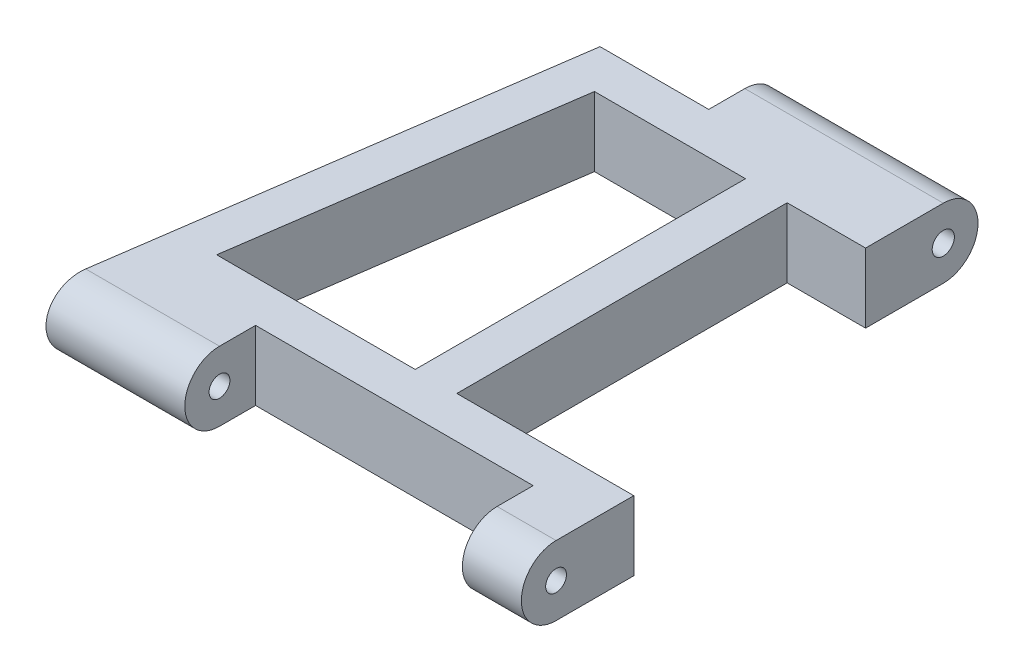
ISO-10303-21;
HEADER;
FILE_DESCRIPTION(('STEP AP214'),'2;1');
FILE_NAME('part.step','',(''),(''),'','','');
FILE_SCHEMA(('AUTOMOTIVE_DESIGN { 1 0 10303 214 1 1 1 1 }'));
ENDSEC;
DATA;
#1=APPLICATION_CONTEXT('core data for automotive mechanical design processes');
#2=APPLICATION_PROTOCOL_DEFINITION('international standard','automotive_design',2000,#1);
#3=PRODUCT_CONTEXT('',#1,'mechanical');
#4=PRODUCT('Part','Part','',(#3));
#5=PRODUCT_RELATED_PRODUCT_CATEGORY('part','',(#4));
#6=PRODUCT_DEFINITION_FORMATION('','',#4);
#7=PRODUCT_DEFINITION_CONTEXT('part definition',#1,'design');
#8=PRODUCT_DEFINITION('design','',#6,#7);
#9=PRODUCT_DEFINITION_SHAPE('','',#8);
#10=(LENGTH_UNIT() NAMED_UNIT(*) SI_UNIT(.MILLI.,.METRE.));
#11=(NAMED_UNIT(*) PLANE_ANGLE_UNIT() SI_UNIT($,.RADIAN.));
#12=(NAMED_UNIT(*) SI_UNIT($,.STERADIAN.) SOLID_ANGLE_UNIT());
#13=UNCERTAINTY_MEASURE_WITH_UNIT(LENGTH_MEASURE(1.E-05),#10,'distance_accuracy_value','');
#14=(GEOMETRIC_REPRESENTATION_CONTEXT(3) GLOBAL_UNCERTAINTY_ASSIGNED_CONTEXT((#13)) GLOBAL_UNIT_ASSIGNED_CONTEXT((#10,
#11,#12)) REPRESENTATION_CONTEXT('',''));
#15=CARTESIAN_POINT('',(0.,0.,0.));
#16=DIRECTION('',(0.,0.,1.));
#17=DIRECTION('',(1.,0.,0.));
#18=AXIS2_PLACEMENT_3D('',#15,#16,#17);
#19=CARTESIAN_POINT('',(-140.419266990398,10.,-20.1852696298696));
#20=DIRECTION('',(0.98982538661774,0.,0.1422873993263));
#21=DIRECTION('',(0.1422873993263,0.,-0.98982538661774));
#22=AXIS2_PLACEMENT_3D('',#19,#20,#21);
#23=PLANE('',#22);
#24=CARTESIAN_POINT('',(-138.818771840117,5.,-31.3191489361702));
#25=DIRECTION('',(0.98982538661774,0.,0.1422873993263));
#26=DIRECTION('',(-0.1422873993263,0.,0.98982538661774));
#27=AXIS2_PLACEMENT_3D('',#24,#25,#26);
#28=ELLIPSE('',#27,1.51541880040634,1.5);
#29=CARTESIAN_POINT('',(-139.034396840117,5.,-29.8191489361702));
#30=VERTEX_POINT('',#29);
#31=EDGE_CURVE('E403',#30,#30,#28,.T.);
#32=ORIENTED_EDGE('',*,*,#31,.T.);
#33=EDGE_LOOP('',(#32));
#34=FACE_BOUND('',#33,.T.);
#35=DIRECTION('',(-0.1422873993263,0.,0.98982538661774));
#36=VECTOR('',#35,1.);
#37=CARTESIAN_POINT('',(-140.419266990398,0.,-20.1852696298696));
#38=LINE('',#37,#36);
#39=CARTESIAN_POINT('',(-129.503771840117,0.,-96.1191489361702));
#40=VERTEX_POINT('',#39);
#41=CARTESIAN_POINT('',(-138.818771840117,0.,-31.3191489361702));
#42=VERTEX_POINT('',#41);
#43=EDGE_CURVE('E293',#40,#42,#38,.T.);
#44=ORIENTED_EDGE('',*,*,#43,.T.);
#45=CARTESIAN_POINT('',(-138.818771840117,5.,-31.3191489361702));
#46=DIRECTION('',(0.98982538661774,0.,0.1422873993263));
#47=DIRECTION('',(-0.1422873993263,0.,0.98982538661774));
#48=AXIS2_PLACEMENT_3D('',#45,#46,#47);
#49=ELLIPSE('',#48,5.05139600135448,5.);
#50=CARTESIAN_POINT('',(-138.818771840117,10.,-31.3191489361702));
#51=VERTEX_POINT('',#50);
#52=EDGE_CURVE('E376',#51,#42,#49,.T.);
#53=ORIENTED_EDGE('',*,*,#52,.F.);
#54=DIRECTION('',(-0.1422873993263,0.,0.98982538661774));
#55=VECTOR('',#54,1.);
#56=CARTESIAN_POINT('',(-140.419266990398,10.,-20.1852696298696));
#57=LINE('',#56,#55);
#58=CARTESIAN_POINT('',(-129.503771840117,10.,-96.1191489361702));
#59=VERTEX_POINT('',#58);
#60=EDGE_CURVE('E331',#59,#51,#57,.T.);
#61=ORIENTED_EDGE('',*,*,#60,.F.);
#62=DIRECTION('',(0.,-1.,0.));
#63=VECTOR('',#62,1.);
#64=CARTESIAN_POINT('',(-129.503771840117,10.,-96.1191489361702));
#65=LINE('',#64,#63);
#66=EDGE_CURVE('E292',#59,#40,#65,.T.);
#67=ORIENTED_EDGE('',*,*,#66,.T.);
#68=EDGE_LOOP('',(#44,#53,#61,#67));
#69=FACE_BOUND('',#68,.T.);
#70=ADVANCED_FACE('F162',(#34,#69),#23,.F.);
#71=CARTESIAN_POINT('',(-119.537521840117,10.,3.25277718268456E-13));
#72=DIRECTION('',(1.,0.,0.));
#73=DIRECTION('',(0.,0.,-1.));
#74=AXIS2_PLACEMENT_3D('',#71,#72,#73);
#75=PLANE('',#74);
#76=CARTESIAN_POINT('',(-119.537521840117,5.,-31.3191489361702));
#77=DIRECTION('',(1.,0.,0.));
#78=DIRECTION('',(0.,0.,-1.));
#79=AXIS2_PLACEMENT_3D('',#76,#77,#78);
#80=CIRCLE('',#79,1.5);
#81=CARTESIAN_POINT('',(-119.537521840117,5.,-32.8191489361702));
#82=VERTEX_POINT('',#81);
#83=EDGE_CURVE('E400',#82,#82,#80,.T.);
#84=ORIENTED_EDGE('',*,*,#83,.F.);
#85=EDGE_LOOP('',(#84));
#86=FACE_BOUND('',#85,.T.);
#87=CARTESIAN_POINT('',(-119.537521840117,5.,-31.3191489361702));
#88=DIRECTION('',(1.,0.,0.));
#89=DIRECTION('',(0.,0.,-1.));
#90=AXIS2_PLACEMENT_3D('',#87,#88,#89);
#91=CIRCLE('',#90,5.);
#92=CARTESIAN_POINT('',(-119.537521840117,10.,-31.3191489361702));
#93=VERTEX_POINT('',#92);
#94=CARTESIAN_POINT('',(-119.537521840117,0.,-31.3191489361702));
#95=VERTEX_POINT('',#94);
#96=EDGE_CURVE('E366',#93,#95,#91,.T.);
#97=ORIENTED_EDGE('',*,*,#96,.T.);
#98=DIRECTION('',(0.,0.,1.));
#99=VECTOR('',#98,1.);
#100=CARTESIAN_POINT('',(-119.537521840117,0.,3.25277718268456E-13));
#101=LINE('',#100,#99);
#102=CARTESIAN_POINT('',(-119.537521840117,0.,-36.5191489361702));
#103=VERTEX_POINT('',#102);
#104=EDGE_CURVE('E296',#103,#95,#101,.T.);
#105=ORIENTED_EDGE('',*,*,#104,.F.);
#106=DIRECTION('',(0.,-1.,0.));
#107=VECTOR('',#106,1.);
#108=CARTESIAN_POINT('',(-119.537521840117,10.,-36.5191489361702));
#109=LINE('',#108,#107);
#110=CARTESIAN_POINT('',(-119.537521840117,10.,-36.5191489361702));
#111=VERTEX_POINT('',#110);
#112=EDGE_CURVE('E165',#111,#103,#109,.T.);
#113=ORIENTED_EDGE('',*,*,#112,.F.);
#114=DIRECTION('',(0.,0.,1.));
#115=VECTOR('',#114,1.);
#116=CARTESIAN_POINT('',(-119.537521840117,10.,3.25277718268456E-13));
#117=LINE('',#116,#115);
#118=EDGE_CURVE('E369',#111,#93,#117,.T.);
#119=ORIENTED_EDGE('',*,*,#118,.T.);
#120=EDGE_LOOP('',(#97,#105,#113,#119));
#121=FACE_BOUND('',#120,.T.);
#122=ADVANCED_FACE('F364',(#86,#121),#75,.T.);
#123=CARTESIAN_POINT('',(-79.5375218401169,10.,0.));
#124=DIRECTION('',(1.,0.,0.));
#125=DIRECTION('',(0.,0.,-1.));
#126=AXIS2_PLACEMENT_3D('',#123,#124,#125);
#127=PLANE('',#126);
#128=CARTESIAN_POINT('',(-79.5375218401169,5.,-31.3191489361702));
#129=DIRECTION('',(1.,0.,0.));
#130=DIRECTION('',(0.,0.,-1.));
#131=AXIS2_PLACEMENT_3D('',#128,#129,#130);
#132=CIRCLE('',#131,1.5);
#133=CARTESIAN_POINT('',(-79.5375218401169,5.,-32.8191489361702));
#134=VERTEX_POINT('',#133);
#135=EDGE_CURVE('E397',#134,#134,#132,.T.);
#136=ORIENTED_EDGE('',*,*,#135,.T.);
#137=EDGE_LOOP('',(#136));
#138=FACE_BOUND('',#137,.T.);
#139=DIRECTION('',(0.,0.,1.));
#140=VECTOR('',#139,1.);
#141=CARTESIAN_POINT('',(-79.5375218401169,0.,0.));
#142=LINE('',#141,#140);
#143=CARTESIAN_POINT('',(-79.5375218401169,0.,-36.5191489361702));
#144=VERTEX_POINT('',#143);
#145=CARTESIAN_POINT('',(-79.5375218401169,0.,-31.3191489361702));
#146=VERTEX_POINT('',#145);
#147=EDGE_CURVE('E302',#144,#146,#142,.T.);
#148=ORIENTED_EDGE('',*,*,#147,.T.);
#149=CARTESIAN_POINT('',(-79.5375218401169,5.,-31.3191489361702));
#150=DIRECTION('',(1.,0.,0.));
#151=DIRECTION('',(0.,0.,-1.));
#152=AXIS2_PLACEMENT_3D('',#149,#150,#151);
#153=CIRCLE('',#152,5.);
#154=CARTESIAN_POINT('',(-79.5375218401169,10.,-31.3191489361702));
#155=VERTEX_POINT('',#154);
#156=EDGE_CURVE('E377',#155,#146,#153,.T.);
#157=ORIENTED_EDGE('',*,*,#156,.F.);
#158=DIRECTION('',(0.,0.,1.));
#159=VECTOR('',#158,1.);
#160=CARTESIAN_POINT('',(-79.5375218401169,10.,0.));
#161=LINE('',#160,#159);
#162=CARTESIAN_POINT('',(-79.5375218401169,10.,-36.5191489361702));
#163=VERTEX_POINT('',#162);
#164=EDGE_CURVE('E426',#163,#155,#161,.T.);
#165=ORIENTED_EDGE('',*,*,#164,.F.);
#166=DIRECTION('',(0.,-1.,0.));
#167=VECTOR('',#166,1.);
#168=CARTESIAN_POINT('',(-79.5375218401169,10.,-36.5191489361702));
#169=LINE('',#168,#167);
#170=EDGE_CURVE('E347',#163,#144,#169,.T.);
#171=ORIENTED_EDGE('',*,*,#170,.T.);
#172=EDGE_LOOP('',(#148,#157,#165,#171));
#173=FACE_BOUND('',#172,.T.);
#174=ADVANCED_FACE('F490',(#138,#173),#127,.F.);
#175=CARTESIAN_POINT('',(-71.0375218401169,10.,0.));
#176=DIRECTION('',(1.,0.,0.));
#177=DIRECTION('',(0.,0.,-1.));
#178=AXIS2_PLACEMENT_3D('',#175,#176,#177);
#179=PLANE('',#178);
#180=CARTESIAN_POINT('',(-71.0375218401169,5.,-31.3191489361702));
#181=DIRECTION('',(-1.,0.,0.));
#182=DIRECTION('',(0.,0.,1.));
#183=AXIS2_PLACEMENT_3D('',#180,#181,#182);
#184=CIRCLE('',#183,1.5);
#185=CARTESIAN_POINT('',(-71.0375218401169,5.,-29.8191489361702));
#186=VERTEX_POINT('',#185);
#187=EDGE_CURVE('E394',#186,#186,#184,.T.);
#188=ORIENTED_EDGE('',*,*,#187,.T.);
#189=EDGE_LOOP('',(#188));
#190=FACE_BOUND('',#189,.T.);
#191=CARTESIAN_POINT('',(-71.0375218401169,5.,-31.3191489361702));
#192=DIRECTION('',(-1.,0.,0.));
#193=DIRECTION('',(0.,0.,1.));
#194=AXIS2_PLACEMENT_3D('',#191,#192,#193);
#195=CIRCLE('',#194,5.);
#196=CARTESIAN_POINT('',(-71.0375218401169,0.,-31.3191489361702));
#197=VERTEX_POINT('',#196);
#198=CARTESIAN_POINT('',(-71.0375218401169,10.,-31.3191489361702));
#199=VERTEX_POINT('',#198);
#200=EDGE_CURVE('E386',#197,#199,#195,.T.);
#201=ORIENTED_EDGE('',*,*,#200,.F.);
#202=DIRECTION('',(0.,0.,1.));
#203=VECTOR('',#202,1.);
#204=CARTESIAN_POINT('',(-71.0375218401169,0.,0.));
#205=LINE('',#204,#203);
#206=CARTESIAN_POINT('',(-71.0375218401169,0.,-42.5191489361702));
#207=VERTEX_POINT('',#206);
#208=EDGE_CURVE('E305',#207,#197,#205,.T.);
#209=ORIENTED_EDGE('',*,*,#208,.F.);
#210=DIRECTION('',(0.,-1.,0.));
#211=VECTOR('',#210,1.);
#212=CARTESIAN_POINT('',(-71.0375218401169,10.,-42.5191489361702));
#213=LINE('',#212,#211);
#214=CARTESIAN_POINT('',(-71.0375218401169,10.,-42.5191489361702));
#215=VERTEX_POINT('',#214);
#216=EDGE_CURVE('E346',#215,#207,#213,.T.);
#217=ORIENTED_EDGE('',*,*,#216,.F.);
#218=DIRECTION('',(0.,0.,1.));
#219=VECTOR('',#218,1.);
#220=CARTESIAN_POINT('',(-71.0375218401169,10.,0.));
#221=LINE('',#220,#219);
#222=EDGE_CURVE('E429',#215,#199,#221,.T.);
#223=ORIENTED_EDGE('',*,*,#222,.T.);
#224=EDGE_LOOP('',(#201,#209,#217,#223));
#225=FACE_BOUND('',#224,.T.);
#226=ADVANCED_FACE('F477',(#190,#225),#179,.T.);
#227=CARTESIAN_POINT('',(-85.2375218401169,10.,0.));
#228=DIRECTION('',(1.,0.,0.));
#229=DIRECTION('',(0.,0.,-1.));
#230=AXIS2_PLACEMENT_3D('',#227,#228,#229);
#231=PLANE('',#230);
#232=CARTESIAN_POINT('',(-85.2375218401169,5.,-101.31914893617));
#233=DIRECTION('',(1.,0.,0.));
#234=DIRECTION('',(0.,0.,-1.));
#235=AXIS2_PLACEMENT_3D('',#232,#233,#234);
#236=CIRCLE('',#235,1.60000000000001);
#237=CARTESIAN_POINT('',(-85.2375218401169,5.,-102.91914893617));
#238=VERTEX_POINT('',#237);
#239=EDGE_CURVE('E297',#238,#238,#236,.F.);
#240=ORIENTED_EDGE('',*,*,#239,.T.);
#241=EDGE_LOOP('',(#240));
#242=FACE_BOUND('',#241,.T.);
#243=DIRECTION('',(0.,0.,1.));
#244=VECTOR('',#243,1.);
#245=CARTESIAN_POINT('',(-85.2375218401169,0.,0.));
#246=LINE('',#245,#244);
#247=CARTESIAN_POINT('',(-85.2375218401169,0.,-101.31914893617));
#248=VERTEX_POINT('',#247);
#249=CARTESIAN_POINT('',(-85.2375218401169,0.,-90.1191489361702));
#250=VERTEX_POINT('',#249);
#251=EDGE_CURVE('E317',#248,#250,#246,.T.);
#252=ORIENTED_EDGE('',*,*,#251,.F.);
#253=CARTESIAN_POINT('',(-85.2375218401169,5.,-101.31914893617));
#254=DIRECTION('',(1.,0.,0.));
#255=DIRECTION('',(0.,0.,-1.));
#256=AXIS2_PLACEMENT_3D('',#253,#254,#255);
#257=CIRCLE('',#256,5.);
#258=CARTESIAN_POINT('',(-85.2375218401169,10.,-101.31914893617));
#259=VERTEX_POINT('',#258);
#260=EDGE_CURVE('E411',#259,#248,#257,.F.);
#261=ORIENTED_EDGE('',*,*,#260,.F.);
#262=DIRECTION('',(0.,0.,1.));
#263=VECTOR('',#262,1.);
#264=CARTESIAN_POINT('',(-85.2375218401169,10.,0.));
#265=LINE('',#264,#263);
#266=CARTESIAN_POINT('',(-85.2375218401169,10.,-90.1191489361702));
#267=VERTEX_POINT('',#266);
#268=EDGE_CURVE('E440',#259,#267,#265,.T.);
#269=ORIENTED_EDGE('',*,*,#268,.T.);
#270=DIRECTION('',(0.,-1.,0.));
#271=VECTOR('',#270,1.);
#272=CARTESIAN_POINT('',(-85.2375218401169,10.,-90.1191489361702));
#273=LINE('',#272,#271);
#274=EDGE_CURVE('E339',#267,#250,#273,.T.);
#275=ORIENTED_EDGE('',*,*,#274,.T.);
#276=EDGE_LOOP('',(#252,#261,#269,#275));
#277=FACE_BOUND('',#276,.T.);
#278=ADVANCED_FACE('F498',(#242,#277),#231,.T.);
#279=CARTESIAN_POINT('',(-113.837521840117,10.,0.));
#280=DIRECTION('',(1.,0.,0.));
#281=DIRECTION('',(0.,0.,-1.));
#282=AXIS2_PLACEMENT_3D('',#279,#280,#281);
#283=PLANE('',#282);
#284=CARTESIAN_POINT('',(-113.837521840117,5.,-101.31914893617));
#285=DIRECTION('',(-1.,0.,0.));
#286=DIRECTION('',(0.,0.,1.));
#287=AXIS2_PLACEMENT_3D('',#284,#285,#286);
#288=CIRCLE('',#287,1.60000000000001);
#289=CARTESIAN_POINT('',(-113.837521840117,5.,-99.7191489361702));
#290=VERTEX_POINT('',#289);
#291=EDGE_CURVE('E413',#290,#290,#288,.T.);
#292=ORIENTED_EDGE('',*,*,#291,.F.);
#293=EDGE_LOOP('',(#292));
#294=FACE_BOUND('',#293,.T.);
#295=CARTESIAN_POINT('',(-113.837521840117,5.,-101.31914893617));
#296=DIRECTION('',(-1.,0.,0.));
#297=DIRECTION('',(0.,0.,1.));
#298=AXIS2_PLACEMENT_3D('',#295,#296,#297);
#299=CIRCLE('',#298,5.);
#300=CARTESIAN_POINT('',(-113.837521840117,10.,-101.31914893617));
#301=VERTEX_POINT('',#300);
#302=CARTESIAN_POINT('',(-113.837521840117,0.,-101.31914893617));
#303=VERTEX_POINT('',#302);
#304=EDGE_CURVE('E178',#301,#303,#299,.T.);
#305=ORIENTED_EDGE('',*,*,#304,.T.);
#306=DIRECTION('',(0.,0.,1.));
#307=VECTOR('',#306,1.);
#308=CARTESIAN_POINT('',(-113.837521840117,0.,0.));
#309=LINE('',#308,#307);
#310=CARTESIAN_POINT('',(-113.837521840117,0.,-96.1191489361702));
#311=VERTEX_POINT('',#310);
#312=EDGE_CURVE('E319',#303,#311,#309,.T.);
#313=ORIENTED_EDGE('',*,*,#312,.T.);
#314=DIRECTION('',(0.,-1.,0.));
#315=VECTOR('',#314,1.);
#316=CARTESIAN_POINT('',(-113.837521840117,10.,-96.1191489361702));
#317=LINE('',#316,#315);
#318=CARTESIAN_POINT('',(-113.837521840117,10.,-96.1191489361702));
#319=VERTEX_POINT('',#318);
#320=EDGE_CURVE('E336',#319,#311,#317,.T.);
#321=ORIENTED_EDGE('',*,*,#320,.F.);
#322=DIRECTION('',(0.,0.,1.));
#323=VECTOR('',#322,1.);
#324=CARTESIAN_POINT('',(-113.837521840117,10.,0.));
#325=LINE('',#324,#323);
#326=EDGE_CURVE('E442',#301,#319,#325,.T.);
#327=ORIENTED_EDGE('',*,*,#326,.F.);
#328=EDGE_LOOP('',(#305,#313,#321,#327));
#329=FACE_BOUND('',#328,.T.);
#330=ADVANCED_FACE('F456',(#294,#329),#283,.F.);
#331=CARTESIAN_POINT('',(0.,0.,0.));
#332=DIRECTION('',(0.,1.,0.));
#333=DIRECTION('',(0.,0.,1.));
#334=AXIS2_PLACEMENT_3D('',#331,#332,#333);
#335=PLANE('',#334);
#336=DIRECTION('',(-1.,0.,0.));
#337=VECTOR('',#336,1.);
#338=CARTESIAN_POINT('',(0.,0.,-42.5191489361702));
#339=LINE('',#338,#337);
#340=CARTESIAN_POINT('',(-102.537521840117,0.,-42.5191489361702));
#341=VERTEX_POINT('',#340);
#342=CARTESIAN_POINT('',(-131.147096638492,0.,-42.5191489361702));
#343=VERTEX_POINT('',#342);
#344=EDGE_CURVE('E324',#341,#343,#339,.T.);
#345=ORIENTED_EDGE('',*,*,#344,.F.);
#346=DIRECTION('',(0.,0.,1.));
#347=VECTOR('',#346,1.);
#348=CARTESIAN_POINT('',(-102.537521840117,0.,0.));
#349=LINE('',#348,#347);
#350=CARTESIAN_POINT('',(-102.537521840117,0.,-90.1191489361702));
#351=VERTEX_POINT('',#350);
#352=EDGE_CURVE('E231',#351,#341,#349,.T.);
#353=ORIENTED_EDGE('',*,*,#352,.F.);
#354=DIRECTION('',(1.,0.,0.));
#355=VECTOR('',#354,1.);
#356=CARTESIAN_POINT('',(0.,0.,-90.1191489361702));
#357=LINE('',#356,#355);
#358=CARTESIAN_POINT('',(-124.304596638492,0.,-90.1191489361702));
#359=VERTEX_POINT('',#358);
#360=EDGE_CURVE('E328',#359,#351,#357,.T.);
#361=ORIENTED_EDGE('',*,*,#360,.F.);
#362=DIRECTION('',(-0.1422873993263,0.,0.98982538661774));
#363=VECTOR('',#362,1.);
#364=CARTESIAN_POINT('',(-134.480314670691,0.,-19.3315452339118));
#365=LINE('',#364,#363);
#366=EDGE_CURVE('E273',#359,#343,#365,.T.);
#367=ORIENTED_EDGE('',*,*,#366,.T.);
#368=EDGE_LOOP('',(#345,#353,#361,#367));
#369=FACE_BOUND('',#368,.T.);
#370=ORIENTED_EDGE('',*,*,#208,.T.);
#371=DIRECTION('',(-1.,0.,0.));
#372=VECTOR('',#371,1.);
#373=CARTESIAN_POINT('',(-71.0375218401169,0.,-31.3191489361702));
#374=LINE('',#373,#372);
#375=EDGE_CURVE('E384',#197,#146,#374,.T.);
#376=ORIENTED_EDGE('',*,*,#375,.T.);
#377=ORIENTED_EDGE('',*,*,#147,.F.);
#378=DIRECTION('',(1.,0.,0.));
#379=VECTOR('',#378,1.);
#380=CARTESIAN_POINT('',(0.,0.,-36.5191489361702));
#381=LINE('',#380,#379);
#382=EDGE_CURVE('E300',#103,#144,#381,.T.);
#383=ORIENTED_EDGE('',*,*,#382,.F.);
#384=ORIENTED_EDGE('',*,*,#104,.T.);
#385=EDGE_CURVE('E380',#95,#42,#374,.T.);
#386=ORIENTED_EDGE('',*,*,#385,.T.);
#387=ORIENTED_EDGE('',*,*,#43,.F.);
#388=DIRECTION('',(1.,0.,0.));
#389=VECTOR('',#388,1.);
#390=CARTESIAN_POINT('',(0.,0.,-96.1191489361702));
#391=LINE('',#390,#389);
#392=EDGE_CURVE('E321',#40,#311,#391,.T.);
#393=ORIENTED_EDGE('',*,*,#392,.T.);
#394=ORIENTED_EDGE('',*,*,#312,.F.);
#395=DIRECTION('',(-1.,0.,0.));
#396=VECTOR('',#395,1.);
#397=CARTESIAN_POINT('',(-78.1664540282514,0.,-101.31914893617));
#398=LINE('',#397,#396);
#399=EDGE_CURVE('E409',#248,#303,#398,.T.);
#400=ORIENTED_EDGE('',*,*,#399,.F.);
#401=ORIENTED_EDGE('',*,*,#251,.T.);
#402=DIRECTION('',(1.,0.,0.));
#403=VECTOR('',#402,1.);
#404=CARTESIAN_POINT('',(0.,0.,-90.1191489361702));
#405=LINE('',#404,#403);
#406=CARTESIAN_POINT('',(-96.5375218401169,0.,-90.1191489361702));
#407=VERTEX_POINT('',#406);
#408=EDGE_CURVE('E314',#407,#250,#405,.T.);
#409=ORIENTED_EDGE('',*,*,#408,.F.);
#410=DIRECTION('',(0.,0.,1.));
#411=VECTOR('',#410,1.);
#412=CARTESIAN_POINT('',(-96.5375218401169,0.,0.));
#413=LINE('',#412,#411);
#414=CARTESIAN_POINT('',(-96.5375218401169,0.,-42.5191489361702));
#415=VERTEX_POINT('',#414);
#416=EDGE_CURVE('E311',#407,#415,#413,.T.);
#417=ORIENTED_EDGE('',*,*,#416,.T.);
#418=DIRECTION('',(-1.,0.,0.));
#419=VECTOR('',#418,1.);
#420=CARTESIAN_POINT('',(0.,0.,-42.5191489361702));
#421=LINE('',#420,#419);
#422=EDGE_CURVE('E308',#207,#415,#421,.T.);
#423=ORIENTED_EDGE('',*,*,#422,.F.);
#424=EDGE_LOOP('',(#370,#376,#377,#383,#384,#386,#387,#393,#394,#400,#401,#409,#417,#423));
#425=FACE_BOUND('',#424,.T.);
#426=ADVANCED_FACE('F359',(#369,#425),#335,.F.);
#427=CARTESIAN_POINT('',(0.,10.,0.));
#428=DIRECTION('',(0.,1.,0.));
#429=DIRECTION('',(0.,0.,1.));
#430=AXIS2_PLACEMENT_3D('',#427,#428,#429);
#431=PLANE('',#430);
#432=DIRECTION('',(-1.,0.,0.));
#433=VECTOR('',#432,1.);
#434=CARTESIAN_POINT('',(-71.0375218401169,10.,-31.3191489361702));
#435=LINE('',#434,#433);
#436=EDGE_CURVE('E391',#199,#155,#435,.T.);
#437=ORIENTED_EDGE('',*,*,#436,.F.);
#438=ORIENTED_EDGE('',*,*,#222,.F.);
#439=DIRECTION('',(-1.,0.,0.));
#440=VECTOR('',#439,1.);
#441=CARTESIAN_POINT('',(0.,10.,-42.5191489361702));
#442=LINE('',#441,#440);
#443=CARTESIAN_POINT('',(-96.5375218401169,10.,-42.5191489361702));
#444=VERTEX_POINT('',#443);
#445=EDGE_CURVE('E432',#215,#444,#442,.T.);
#446=ORIENTED_EDGE('',*,*,#445,.T.);
#447=DIRECTION('',(0.,0.,1.));
#448=VECTOR('',#447,1.);
#449=CARTESIAN_POINT('',(-96.5375218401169,10.,0.));
#450=LINE('',#449,#448);
#451=CARTESIAN_POINT('',(-96.5375218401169,10.,-90.1191489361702));
#452=VERTEX_POINT('',#451);
#453=EDGE_CURVE('E434',#452,#444,#450,.T.);
#454=ORIENTED_EDGE('',*,*,#453,.F.);
#455=DIRECTION('',(1.,0.,0.));
#456=VECTOR('',#455,1.);
#457=CARTESIAN_POINT('',(0.,10.,-90.1191489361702));
#458=LINE('',#457,#456);
#459=EDGE_CURVE('E437',#452,#267,#458,.T.);
#460=ORIENTED_EDGE('',*,*,#459,.T.);
#461=ORIENTED_EDGE('',*,*,#268,.F.);
#462=DIRECTION('',(-1.,0.,0.));
#463=VECTOR('',#462,1.);
#464=CARTESIAN_POINT('',(-78.1664540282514,10.,-101.31914893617));
#465=LINE('',#464,#463);
#466=EDGE_CURVE('E414',#259,#301,#465,.T.);
#467=ORIENTED_EDGE('',*,*,#466,.T.);
#468=ORIENTED_EDGE('',*,*,#326,.T.);
#469=DIRECTION('',(1.,0.,0.));
#470=VECTOR('',#469,1.);
#471=CARTESIAN_POINT('',(0.,10.,-96.1191489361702));
#472=LINE('',#471,#470);
#473=EDGE_CURVE('E287',#59,#319,#472,.T.);
#474=ORIENTED_EDGE('',*,*,#473,.F.);
#475=ORIENTED_EDGE('',*,*,#60,.T.);
#476=EDGE_CURVE('E390',#93,#51,#435,.T.);
#477=ORIENTED_EDGE('',*,*,#476,.F.);
#478=ORIENTED_EDGE('',*,*,#118,.F.);
#479=DIRECTION('',(1.,0.,0.));
#480=VECTOR('',#479,1.);
#481=CARTESIAN_POINT('',(0.,10.,-36.5191489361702));
#482=LINE('',#481,#480);
#483=EDGE_CURVE('E356',#111,#163,#482,.T.);
#484=ORIENTED_EDGE('',*,*,#483,.T.);
#485=ORIENTED_EDGE('',*,*,#164,.T.);
#486=EDGE_LOOP('',(#437,#438,#446,#454,#460,#461,#467,#468,#474,#475,#477,#478,#484,#485));
#487=FACE_BOUND('',#486,.T.);
#488=DIRECTION('',(-1.,0.,0.));
#489=VECTOR('',#488,1.);
#490=CARTESIAN_POINT('',(0.,10.,-42.5191489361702));
#491=LINE('',#490,#489);
#492=CARTESIAN_POINT('',(-102.537521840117,10.,-42.5191489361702));
#493=VERTEX_POINT('',#492);
#494=CARTESIAN_POINT('',(-131.147096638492,10.,-42.5191489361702));
#495=VERTEX_POINT('',#494);
#496=EDGE_CURVE('E284',#493,#495,#491,.T.);
#497=ORIENTED_EDGE('',*,*,#496,.T.);
#498=DIRECTION('',(-0.1422873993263,0.,0.98982538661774));
#499=VECTOR('',#498,1.);
#500=CARTESIAN_POINT('',(-134.480314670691,10.,-19.3315452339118));
#501=LINE('',#500,#499);
#502=CARTESIAN_POINT('',(-124.304596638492,10.,-90.1191489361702));
#503=VERTEX_POINT('',#502);
#504=EDGE_CURVE('E271',#503,#495,#501,.T.);
#505=ORIENTED_EDGE('',*,*,#504,.F.);
#506=DIRECTION('',(1.,0.,0.));
#507=VECTOR('',#506,1.);
#508=CARTESIAN_POINT('',(0.,10.,-90.1191489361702));
#509=LINE('',#508,#507);
#510=CARTESIAN_POINT('',(-102.537521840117,10.,-90.1191489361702));
#511=VERTEX_POINT('',#510);
#512=EDGE_CURVE('E279',#503,#511,#509,.T.);
#513=ORIENTED_EDGE('',*,*,#512,.T.);
#514=DIRECTION('',(0.,0.,1.));
#515=VECTOR('',#514,1.);
#516=CARTESIAN_POINT('',(-102.537521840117,10.,0.));
#517=LINE('',#516,#515);
#518=EDGE_CURVE('E187',#511,#493,#517,.T.);
#519=ORIENTED_EDGE('',*,*,#518,.T.);
#520=EDGE_LOOP('',(#497,#505,#513,#519));
#521=FACE_BOUND('',#520,.T.);
#522=ADVANCED_FACE('F282',(#487,#521),#431,.T.);
#523=CARTESIAN_POINT('',(0.,10.,-42.5191489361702));
#524=DIRECTION('',(0.,0.,1.));
#525=DIRECTION('',(1.,0.,0.));
#526=AXIS2_PLACEMENT_3D('',#523,#524,#525);
#527=PLANE('',#526);
#528=ORIENTED_EDGE('',*,*,#344,.T.);
#529=DIRECTION('',(0.,-1.,0.));
#530=VECTOR('',#529,1.);
#531=CARTESIAN_POINT('',(-131.147096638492,10.,-42.5191489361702));
#532=LINE('',#531,#530);
#533=EDGE_CURVE('E12',#495,#343,#532,.T.);
#534=ORIENTED_EDGE('',*,*,#533,.F.);
#535=ORIENTED_EDGE('',*,*,#496,.F.);
#536=DIRECTION('',(0.,-1.,0.));
#537=VECTOR('',#536,1.);
#538=CARTESIAN_POINT('',(-102.537521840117,10.,-42.5191489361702));
#539=LINE('',#538,#537);
#540=EDGE_CURVE('E332',#493,#341,#539,.T.);
#541=ORIENTED_EDGE('',*,*,#540,.T.);
#542=EDGE_LOOP('',(#528,#534,#535,#541));
#543=FACE_BOUND('',#542,.T.);
#544=ADVANCED_FACE('F541',(#543),#527,.F.);
#545=CARTESIAN_POINT('',(-134.480314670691,10.,-19.3315452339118));
#546=DIRECTION('',(0.98982538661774,0.,0.1422873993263));
#547=DIRECTION('',(0.1422873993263,0.,-0.98982538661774));
#548=AXIS2_PLACEMENT_3D('',#545,#546,#547);
#549=PLANE('',#548);
#550=ORIENTED_EDGE('',*,*,#366,.F.);
#551=DIRECTION('',(0.,-1.,0.));
#552=VECTOR('',#551,1.);
#553=CARTESIAN_POINT('',(-124.304596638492,10.,-90.1191489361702));
#554=LINE('',#553,#552);
#555=EDGE_CURVE('E170',#503,#359,#554,.T.);
#556=ORIENTED_EDGE('',*,*,#555,.F.);
#557=ORIENTED_EDGE('',*,*,#504,.T.);
#558=ORIENTED_EDGE('',*,*,#533,.T.);
#559=EDGE_LOOP('',(#550,#556,#557,#558));
#560=FACE_BOUND('',#559,.T.);
#561=ADVANCED_FACE('F269',(#560),#549,.T.);
#562=CARTESIAN_POINT('',(0.,10.,-90.1191489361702));
#563=DIRECTION('',(0.,0.,-1.));
#564=DIRECTION('',(-1.,0.,0.));
#565=AXIS2_PLACEMENT_3D('',#562,#563,#564);
#566=PLANE('',#565);
#567=ORIENTED_EDGE('',*,*,#360,.T.);
#568=DIRECTION('',(0.,-1.,0.));
#569=VECTOR('',#568,1.);
#570=CARTESIAN_POINT('',(-102.537521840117,10.,-90.1191489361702));
#571=LINE('',#570,#569);
#572=EDGE_CURVE('E276',#511,#351,#571,.T.);
#573=ORIENTED_EDGE('',*,*,#572,.F.);
#574=ORIENTED_EDGE('',*,*,#512,.F.);
#575=ORIENTED_EDGE('',*,*,#555,.T.);
#576=EDGE_LOOP('',(#567,#573,#574,#575));
#577=FACE_BOUND('',#576,.T.);
#578=ADVANCED_FACE('F280',(#577),#566,.F.);
#579=CARTESIAN_POINT('',(0.,10.,-36.5191489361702));
#580=DIRECTION('',(0.,0.,-1.));
#581=DIRECTION('',(-1.,0.,0.));
#582=AXIS2_PLACEMENT_3D('',#579,#580,#581);
#583=PLANE('',#582);
#584=ORIENTED_EDGE('',*,*,#382,.T.);
#585=ORIENTED_EDGE('',*,*,#170,.F.);
#586=ORIENTED_EDGE('',*,*,#483,.F.);
#587=ORIENTED_EDGE('',*,*,#112,.T.);
#588=EDGE_LOOP('',(#584,#585,#586,#587));
#589=FACE_BOUND('',#588,.T.);
#590=ADVANCED_FACE('F355',(#589),#583,.F.);
#591=CARTESIAN_POINT('',(0.,10.,-42.5191489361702));
#592=DIRECTION('',(0.,0.,1.));
#593=DIRECTION('',(1.,0.,0.));
#594=AXIS2_PLACEMENT_3D('',#591,#592,#593);
#595=PLANE('',#594);
#596=ORIENTED_EDGE('',*,*,#422,.T.);
#597=DIRECTION('',(0.,-1.,0.));
#598=VECTOR('',#597,1.);
#599=CARTESIAN_POINT('',(-96.5375218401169,10.,-42.5191489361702));
#600=LINE('',#599,#598);
#601=EDGE_CURVE('E344',#444,#415,#600,.T.);
#602=ORIENTED_EDGE('',*,*,#601,.F.);
#603=ORIENTED_EDGE('',*,*,#445,.F.);
#604=ORIENTED_EDGE('',*,*,#216,.T.);
#605=EDGE_LOOP('',(#596,#602,#603,#604));
#606=FACE_BOUND('',#605,.T.);
#607=ADVANCED_FACE('F487',(#606),#595,.F.);
#608=CARTESIAN_POINT('',(-96.5375218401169,10.,0.));
#609=DIRECTION('',(1.,0.,0.));
#610=DIRECTION('',(0.,0.,-1.));
#611=AXIS2_PLACEMENT_3D('',#608,#609,#610);
#612=PLANE('',#611);
#613=ORIENTED_EDGE('',*,*,#416,.F.);
#614=DIRECTION('',(0.,-1.,0.));
#615=VECTOR('',#614,1.);
#616=CARTESIAN_POINT('',(-96.5375218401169,10.,-90.1191489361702));
#617=LINE('',#616,#615);
#618=EDGE_CURVE('E342',#452,#407,#617,.T.);
#619=ORIENTED_EDGE('',*,*,#618,.F.);
#620=ORIENTED_EDGE('',*,*,#453,.T.);
#621=ORIENTED_EDGE('',*,*,#601,.T.);
#622=EDGE_LOOP('',(#613,#619,#620,#621));
#623=FACE_BOUND('',#622,.T.);
#624=ADVANCED_FACE('F565',(#623),#612,.T.);
#625=CARTESIAN_POINT('',(0.,10.,-90.1191489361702));
#626=DIRECTION('',(0.,0.,-1.));
#627=DIRECTION('',(-1.,0.,0.));
#628=AXIS2_PLACEMENT_3D('',#625,#626,#627);
#629=PLANE('',#628);
#630=ORIENTED_EDGE('',*,*,#408,.T.);
#631=ORIENTED_EDGE('',*,*,#274,.F.);
#632=ORIENTED_EDGE('',*,*,#459,.F.);
#633=ORIENTED_EDGE('',*,*,#618,.T.);
#634=EDGE_LOOP('',(#630,#631,#632,#633));
#635=FACE_BOUND('',#634,.T.);
#636=ADVANCED_FACE('F556',(#635),#629,.F.);
#637=CARTESIAN_POINT('',(0.,10.,-96.1191489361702));
#638=DIRECTION('',(0.,0.,-1.));
#639=DIRECTION('',(-1.,0.,0.));
#640=AXIS2_PLACEMENT_3D('',#637,#638,#639);
#641=PLANE('',#640);
#642=ORIENTED_EDGE('',*,*,#392,.F.);
#643=ORIENTED_EDGE('',*,*,#66,.F.);
#644=ORIENTED_EDGE('',*,*,#473,.T.);
#645=ORIENTED_EDGE('',*,*,#320,.T.);
#646=EDGE_LOOP('',(#642,#643,#644,#645));
#647=FACE_BOUND('',#646,.T.);
#648=ADVANCED_FACE('F447',(#647),#641,.T.);
#649=CARTESIAN_POINT('',(-102.537521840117,10.,0.));
#650=DIRECTION('',(1.,0.,0.));
#651=DIRECTION('',(0.,0.,-1.));
#652=AXIS2_PLACEMENT_3D('',#649,#650,#651);
#653=PLANE('',#652);
#654=ORIENTED_EDGE('',*,*,#352,.T.);
#655=ORIENTED_EDGE('',*,*,#540,.F.);
#656=ORIENTED_EDGE('',*,*,#518,.F.);
#657=ORIENTED_EDGE('',*,*,#572,.T.);
#658=EDGE_LOOP('',(#654,#655,#656,#657));
#659=FACE_BOUND('',#658,.T.);
#660=ADVANCED_FACE('F536',(#659),#653,.F.);
#661=CARTESIAN_POINT('',(-78.1664540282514,5.,-101.31914893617));
#662=DIRECTION('',(-1.,0.,0.));
#663=DIRECTION('',(0.,0.,1.));
#664=AXIS2_PLACEMENT_3D('',#661,#662,#663);
#665=CYLINDRICAL_SURFACE('',#664,5.);
#666=ORIENTED_EDGE('',*,*,#260,.T.);
#667=ORIENTED_EDGE('',*,*,#399,.T.);
#668=ORIENTED_EDGE('',*,*,#304,.F.);
#669=ORIENTED_EDGE('',*,*,#466,.F.);
#670=EDGE_LOOP('',(#666,#667,#668,#669));
#671=FACE_BOUND('',#670,.T.);
#672=ADVANCED_FACE('F527',(#671),#665,.T.);
#673=CARTESIAN_POINT('',(-78.1664540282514,5.,-101.31914893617));
#674=DIRECTION('',(-1.,0.,0.));
#675=DIRECTION('',(0.,0.,1.));
#676=AXIS2_PLACEMENT_3D('',#673,#674,#675);
#677=CYLINDRICAL_SURFACE('',#676,1.60000000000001);
#678=ORIENTED_EDGE('',*,*,#291,.T.);
#679=EDGE_LOOP('',(#678));
#680=FACE_BOUND('',#679,.T.);
#681=ORIENTED_EDGE('',*,*,#239,.F.);
#682=EDGE_LOOP('',(#681));
#683=FACE_BOUND('',#682,.T.);
#684=ADVANCED_FACE('F522',(#680,#683),#677,.F.);
#685=CARTESIAN_POINT('',(-71.0375218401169,5.,-31.3191489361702));
#686=DIRECTION('',(-1.,0.,0.));
#687=DIRECTION('',(0.,0.,1.));
#688=AXIS2_PLACEMENT_3D('',#685,#686,#687);
#689=CYLINDRICAL_SURFACE('',#688,1.5);
#690=ORIENTED_EDGE('',*,*,#187,.F.);
#691=EDGE_LOOP('',(#690));
#692=FACE_BOUND('',#691,.T.);
#693=ORIENTED_EDGE('',*,*,#135,.F.);
#694=EDGE_LOOP('',(#693));
#695=FACE_BOUND('',#694,.T.);
#696=ADVANCED_FACE('F514',(#692,#695),#689,.F.);
#697=CARTESIAN_POINT('',(-71.0375218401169,5.,-31.3191489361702));
#698=DIRECTION('',(-1.,0.,0.));
#699=DIRECTION('',(0.,0.,1.));
#700=AXIS2_PLACEMENT_3D('',#697,#698,#699);
#701=CYLINDRICAL_SURFACE('',#700,5.);
#702=ORIENTED_EDGE('',*,*,#156,.T.);
#703=ORIENTED_EDGE('',*,*,#375,.F.);
#704=ORIENTED_EDGE('',*,*,#200,.T.);
#705=ORIENTED_EDGE('',*,*,#436,.T.);
#706=EDGE_LOOP('',(#702,#703,#704,#705));
#707=FACE_BOUND('',#706,.T.);
#708=ADVANCED_FACE('F480',(#707),#701,.T.);
#709=ORIENTED_EDGE('',*,*,#83,.T.);
#710=EDGE_LOOP('',(#709));
#711=FACE_BOUND('',#710,.T.);
#712=ORIENTED_EDGE('',*,*,#31,.F.);
#713=EDGE_LOOP('',(#712));
#714=FACE_BOUND('',#713,.T.);
#715=ADVANCED_FACE('F510',(#711,#714),#689,.F.);
#716=ORIENTED_EDGE('',*,*,#52,.T.);
#717=ORIENTED_EDGE('',*,*,#385,.F.);
#718=ORIENTED_EDGE('',*,*,#96,.F.);
#719=ORIENTED_EDGE('',*,*,#476,.T.);
#720=EDGE_LOOP('',(#716,#717,#718,#719));
#721=FACE_BOUND('',#720,.T.);
#722=ADVANCED_FACE('F381',(#721),#701,.T.);
#723=CLOSED_SHELL('',(#70,#122,#174,#226,#278,#330,#426,#522,#544,#561,#578,#590,#607,#624,#636,
#648,#660,#672,#684,#696,#708,#715,#722));
#724=MANIFOLD_SOLID_BREP('B2',#723);
#725=ADVANCED_BREP_SHAPE_REPRESENTATION('',(#18,#724),#14);
#726=SHAPE_DEFINITION_REPRESENTATION(#9,#725);
ENDSEC;
END-ISO-10303-21;
